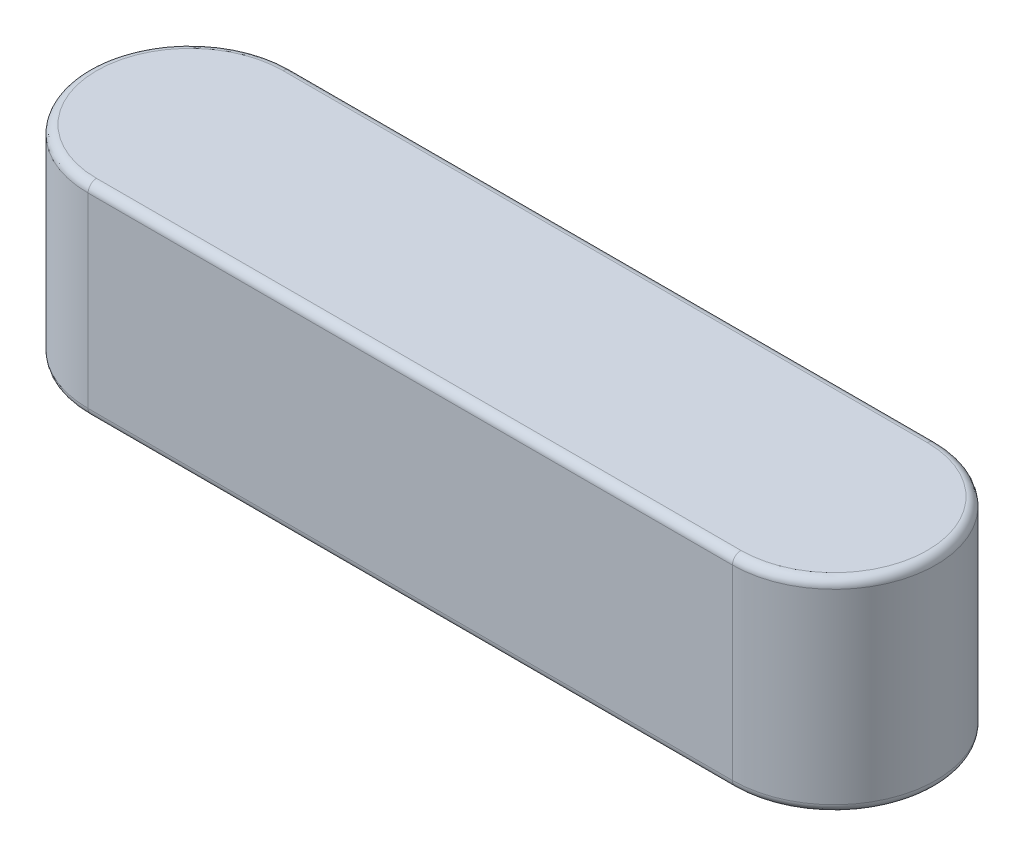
from build123d import *

# Parameters (mm, degrees)
EXTRUDE1_DEPTH = 6
FILLET1_R      = 0.25


with BuildPart() as part:
    # Sketch1 → Extrude1 (new body)
    with BuildSketch(Plane(origin=(0, 0, 0), x_dir=(1, 0, 0), z_dir=(0, 1, 0))):
        with BuildLine():
            Line((-19, 3), (0, 3))
            ThreePointArc((0, 3), (3, 0), (0, -3))
            Line((0, -3), (-19, -3))
            ThreePointArc((-19, -3), (-22, 0), (-19, 3))
        make_face()
    extrude(amount=EXTRUDE1_DEPTH)

    # Fillet1
    fillet1_edges = [part.edges().sort_by_distance(p)[0] for p in [
        (3, 6, 0),
        (-9.5, 6, -3),
        (-22, 6, 0),
        (-9.5, 0, -3),
        (3, 0, 0),
        (-9.5, 0, 3),
        (-22, 0, 0),
        (-9.5, 6, 3),
    ]]
    fillet(fillet1_edges, radius=FILLET1_R)


solid = part.part
